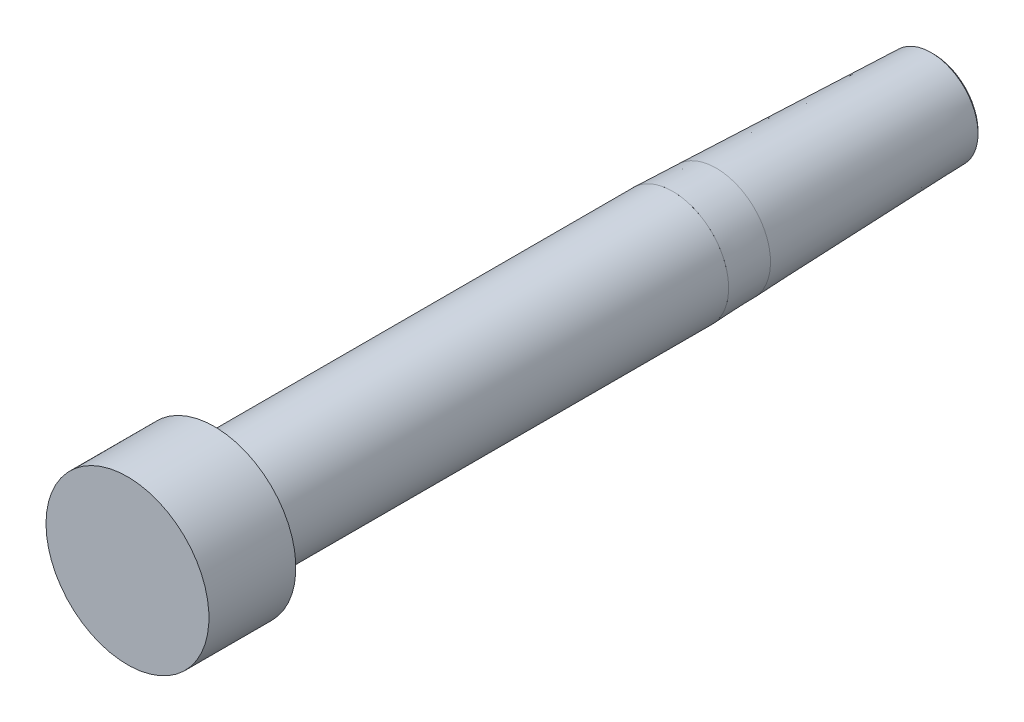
ISO-10303-21;
HEADER;
FILE_DESCRIPTION(('STEP AP214'),'2;1');
FILE_NAME('part.step','',(''),(''),'','','');
FILE_SCHEMA(('AUTOMOTIVE_DESIGN { 1 0 10303 214 1 1 1 1 }'));
ENDSEC;
DATA;
#1=APPLICATION_CONTEXT('core data for automotive mechanical design processes');
#2=APPLICATION_PROTOCOL_DEFINITION('international standard','automotive_design',2000,#1);
#3=PRODUCT_CONTEXT('',#1,'mechanical');
#4=PRODUCT('Part','Part','',(#3));
#5=PRODUCT_RELATED_PRODUCT_CATEGORY('part','',(#4));
#6=PRODUCT_DEFINITION_FORMATION('','',#4);
#7=PRODUCT_DEFINITION_CONTEXT('part definition',#1,'design');
#8=PRODUCT_DEFINITION('design','',#6,#7);
#9=PRODUCT_DEFINITION_SHAPE('','',#8);
#10=(LENGTH_UNIT() NAMED_UNIT(*) SI_UNIT(.MILLI.,.METRE.));
#11=(NAMED_UNIT(*) PLANE_ANGLE_UNIT() SI_UNIT($,.RADIAN.));
#12=(NAMED_UNIT(*) SI_UNIT($,.STERADIAN.) SOLID_ANGLE_UNIT());
#13=UNCERTAINTY_MEASURE_WITH_UNIT(LENGTH_MEASURE(1.E-05),#10,'distance_accuracy_value','');
#14=(GEOMETRIC_REPRESENTATION_CONTEXT(3) GLOBAL_UNCERTAINTY_ASSIGNED_CONTEXT((#13)) GLOBAL_UNIT_ASSIGNED_CONTEXT((#10,
#11,#12)) REPRESENTATION_CONTEXT('',''));
#15=CARTESIAN_POINT('',(0.,0.,0.));
#16=DIRECTION('',(0.,0.,1.));
#17=DIRECTION('',(1.,0.,0.));
#18=AXIS2_PLACEMENT_3D('',#15,#16,#17);
#19=CARTESIAN_POINT('',(-5.50000000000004,49.3508529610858,-37.1));
#20=DIRECTION('',(0.,0.,-1.));
#21=DIRECTION('',(0.866025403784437,0.500000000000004,0.));
#22=AXIS2_PLACEMENT_3D('',#19,#20,#21);
#23=PLANE('',#22);
#24=CARTESIAN_POINT('',(-5.50000000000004,49.3508529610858,-37.1));
#25=DIRECTION('',(0.,0.,-1.));
#26=DIRECTION('',(0.866025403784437,0.500000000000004,0.));
#27=AXIS2_PLACEMENT_3D('',#24,#25,#26);
#28=CIRCLE('',#27,2.05079230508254);
#29=CARTESIAN_POINT('',(-3.72396176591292,50.3762491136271,-37.1));
#30=VERTEX_POINT('',#29);
#31=EDGE_CURVE('E44',#30,#30,#28,.F.);
#32=ORIENTED_EDGE('',*,*,#31,.F.);
#33=EDGE_LOOP('',(#32));
#34=FACE_BOUND('',#33,.T.);
#35=ADVANCED_FACE('F31',(#34),#23,.T.);
#36=CARTESIAN_POINT('',(-5.50000000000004,49.3508529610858,-36.9963815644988));
#37=DIRECTION('',(0.,0.,1.));
#38=DIRECTION('',(-0.866025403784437,-0.500000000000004,0.));
#39=AXIS2_PLACEMENT_3D('',#36,#37,#38);
#40=CONICAL_SURFACE('',#39,2.15441074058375,0.785398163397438);
#41=ORIENTED_EDGE('',*,*,#31,.T.);
#42=EDGE_LOOP('',(#41));
#43=FACE_BOUND('',#42,.T.);
#44=CARTESIAN_POINT('',(-5.50000000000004,49.3508529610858,-36.9963815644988));
#45=DIRECTION('',(0.,0.,-1.));
#46=DIRECTION('',(0.866025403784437,0.500000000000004,0.));
#47=AXIS2_PLACEMENT_3D('',#44,#45,#46);
#48=CIRCLE('',#47,2.15441074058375);
#49=CARTESIAN_POINT('',(-3.63422556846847,50.4280583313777,-36.9963815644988));
#50=VERTEX_POINT('',#49);
#51=EDGE_CURVE('E52',#50,#50,#48,.T.);
#52=ORIENTED_EDGE('',*,*,#51,.T.);
#53=EDGE_LOOP('',(#52));
#54=FACE_BOUND('',#53,.T.);
#55=ADVANCED_FACE('F83',(#43,#54),#40,.T.);
#56=CARTESIAN_POINT('',(-5.50000000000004,49.3508529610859,-27.1));
#57=DIRECTION('',(0.,0.,1.));
#58=DIRECTION('',(-0.866025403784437,-0.500000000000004,0.));
#59=AXIS2_PLACEMENT_3D('',#56,#57,#58);
#60=CONICAL_SURFACE('',#59,2.5,0.0349065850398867);
#61=ORIENTED_EDGE('',*,*,#51,.F.);
#62=EDGE_LOOP('',(#61));
#63=FACE_BOUND('',#62,.T.);
#64=CARTESIAN_POINT('',(-5.50000000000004,49.3508529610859,-27.1));
#65=DIRECTION('',(0.,0.,1.));
#66=DIRECTION('',(-0.866025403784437,-0.500000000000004,0.));
#67=AXIS2_PLACEMENT_3D('',#64,#65,#66);
#68=CIRCLE('',#67,2.5);
#69=CARTESIAN_POINT('',(-7.66506350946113,48.1008529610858,-27.1));
#70=VERTEX_POINT('',#69);
#71=EDGE_CURVE('E54',#70,#70,#68,.T.);
#72=ORIENTED_EDGE('',*,*,#71,.F.);
#73=EDGE_LOOP('',(#72));
#74=FACE_BOUND('',#73,.T.);
#75=ADVANCED_FACE('F89',(#63,#74),#60,.T.);
#76=CARTESIAN_POINT('',(-5.50000000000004,49.3508529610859,-27.1));
#77=DIRECTION('',(0.,0.,1.));
#78=DIRECTION('',(-0.866025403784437,-0.500000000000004,0.));
#79=AXIS2_PLACEMENT_3D('',#76,#77,#78);
#80=CONICAL_SURFACE('',#79,2.5,0.0349065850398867);
#81=CARTESIAN_POINT('',(-5.50000000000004,49.3508529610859,-25.1));
#82=DIRECTION('',(0.,0.,1.));
#83=DIRECTION('',(-0.866025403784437,-0.500000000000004,0.));
#84=AXIS2_PLACEMENT_3D('',#81,#82,#83);
#85=CIRCLE('',#84,2.56984153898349);
#86=CARTESIAN_POINT('',(-7.72554805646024,48.0659321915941,-25.1));
#87=VERTEX_POINT('',#86);
#88=EDGE_CURVE('E35',#87,#87,#85,.T.);
#89=ORIENTED_EDGE('',*,*,#88,.F.);
#90=EDGE_LOOP('',(#89));
#91=FACE_BOUND('',#90,.T.);
#92=ORIENTED_EDGE('',*,*,#71,.T.);
#93=EDGE_LOOP('',(#92));
#94=FACE_BOUND('',#93,.T.);
#95=ADVANCED_FACE('F96',(#91,#94),#80,.T.);
#96=CARTESIAN_POINT('',(-5.50000000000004,49.3508529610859,-25.1));
#97=DIRECTION('',(0.,0.,1.));
#98=DIRECTION('',(-0.866025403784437,-0.500000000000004,0.));
#99=AXIS2_PLACEMENT_3D('',#96,#97,#98);
#100=PLANE('',#99);
#101=CARTESIAN_POINT('',(-5.50000000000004,49.3508529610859,-25.100000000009));
#102=DIRECTION('',(0.,0.,1.));
#103=DIRECTION('',(0.,-1.,0.));
#104=AXIS2_PLACEMENT_3D('',#101,#102,#103);
#105=CIRCLE('',#104,2.57);
#106=CARTESIAN_POINT('',(-5.50000000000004,46.7808529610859,-25.100000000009));
#107=VERTEX_POINT('',#106);
#108=EDGE_CURVE('E39',#107,#107,#105,.F.);
#109=ORIENTED_EDGE('',*,*,#108,.T.);
#110=EDGE_LOOP('',(#109));
#111=FACE_BOUND('',#110,.T.);
#112=ORIENTED_EDGE('',*,*,#88,.T.);
#113=EDGE_LOOP('',(#112));
#114=FACE_BOUND('',#113,.T.);
#115=ADVANCED_FACE('F79',(#111,#114),#100,.F.);
#116=CARTESIAN_POINT('',(-5.50000000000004,49.3508529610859,-500000.));
#117=DIRECTION('',(0.,0.,1.));
#118=DIRECTION('',(1.,0.,0.));
#119=AXIS2_PLACEMENT_3D('',#116,#117,#118);
#120=CYLINDRICAL_SURFACE('',#119,2.57);
#121=ORIENTED_EDGE('',*,*,#108,.F.);
#122=EDGE_LOOP('',(#121));
#123=FACE_BOUND('',#122,.T.);
#124=CARTESIAN_POINT('',(-5.50000000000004,49.3508529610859,-4.));
#125=DIRECTION('',(0.,0.,1.));
#126=DIRECTION('',(1.,0.,0.));
#127=AXIS2_PLACEMENT_3D('',#124,#125,#126);
#128=CIRCLE('',#127,2.57);
#129=CARTESIAN_POINT('',(-2.93000000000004,49.3508529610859,-4.));
#130=VERTEX_POINT('',#129);
#131=EDGE_CURVE('E10',#130,#130,#128,.T.);
#132=ORIENTED_EDGE('',*,*,#131,.F.);
#133=EDGE_LOOP('',(#132));
#134=FACE_BOUND('',#133,.T.);
#135=ADVANCED_FACE('F33',(#123,#134),#120,.T.);
#136=CARTESIAN_POINT('',(-5.50000000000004,49.3508529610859,-4.));
#137=DIRECTION('',(0.,0.,1.));
#138=DIRECTION('',(1.,0.,0.));
#139=AXIS2_PLACEMENT_3D('',#136,#137,#138);
#140=PLANE('',#139);
#141=ORIENTED_EDGE('',*,*,#131,.T.);
#142=EDGE_LOOP('',(#141));
#143=FACE_BOUND('',#142,.T.);
#144=CARTESIAN_POINT('',(-5.50000000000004,49.3508529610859,-4.));
#145=DIRECTION('',(0.,0.,1.));
#146=DIRECTION('',(1.,0.,0.));
#147=AXIS2_PLACEMENT_3D('',#144,#145,#146);
#148=CIRCLE('',#147,3.75);
#149=CARTESIAN_POINT('',(-9.25000000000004,49.3508529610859,-4.));
#150=VERTEX_POINT('',#149);
#151=EDGE_CURVE('E62',#150,#150,#148,.T.);
#152=ORIENTED_EDGE('',*,*,#151,.F.);
#153=EDGE_LOOP('',(#152));
#154=FACE_BOUND('',#153,.T.);
#155=ADVANCED_FACE('F70',(#143,#154),#140,.F.);
#156=CARTESIAN_POINT('',(-5.50000000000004,49.3508529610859,10.6066017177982));
#157=DIRECTION('',(0.,0.,-1.));
#158=DIRECTION('',(-1.,0.,0.));
#159=AXIS2_PLACEMENT_3D('',#156,#157,#158);
#160=CYLINDRICAL_SURFACE('',#159,3.75);
#161=CARTESIAN_POINT('',(-5.50000000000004,49.3508529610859,0.));
#162=DIRECTION('',(0.,0.,-1.));
#163=DIRECTION('',(-1.,0.,0.));
#164=AXIS2_PLACEMENT_3D('',#161,#162,#163);
#165=CIRCLE('',#164,3.75);
#166=CARTESIAN_POINT('',(-9.25000000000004,49.3508529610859,0.));
#167=VERTEX_POINT('',#166);
#168=EDGE_CURVE('E47',#167,#167,#165,.T.);
#169=CARTESIAN_POINT('',(-9.25000000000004,49.3508529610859,0.));
#170=CARTESIAN_POINT('',(-9.25000000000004,49.3508529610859,-0.0416666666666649));
#171=CARTESIAN_POINT('',(-9.25000000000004,49.3508529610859,-0.0833333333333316));
#172=CARTESIAN_POINT('',(-9.25000000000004,49.3508529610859,-0.166666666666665));
#173=CARTESIAN_POINT('',(-9.25000000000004,49.3508529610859,-0.208333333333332));
#174=CARTESIAN_POINT('',(-9.25000000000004,49.3508529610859,-0.291666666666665));
#175=CARTESIAN_POINT('',(-9.25000000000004,49.3508529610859,-0.333333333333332));
#176=CARTESIAN_POINT('',(-9.25000000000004,49.3508529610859,-0.416666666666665));
#177=CARTESIAN_POINT('',(-9.25000000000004,49.3508529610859,-0.458333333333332));
#178=CARTESIAN_POINT('',(-9.25000000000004,49.3508529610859,-0.541666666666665));
#179=CARTESIAN_POINT('',(-9.25000000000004,49.3508529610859,-0.583333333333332));
#180=CARTESIAN_POINT('',(-9.25000000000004,49.3508529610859,-0.666666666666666));
#181=CARTESIAN_POINT('',(-9.25000000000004,49.3508529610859,-0.708333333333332));
#182=CARTESIAN_POINT('',(-9.25000000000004,49.3508529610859,-0.791666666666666));
#183=CARTESIAN_POINT('',(-9.25000000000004,49.3508529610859,-0.833333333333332));
#184=CARTESIAN_POINT('',(-9.25000000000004,49.3508529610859,-0.916666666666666));
#185=CARTESIAN_POINT('',(-9.25000000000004,49.3508529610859,-0.958333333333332));
#186=CARTESIAN_POINT('',(-9.25000000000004,49.3508529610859,-1.04166666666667));
#187=CARTESIAN_POINT('',(-9.25000000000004,49.3508529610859,-1.08333333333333));
#188=CARTESIAN_POINT('',(-9.25000000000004,49.3508529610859,-1.16666666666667));
#189=CARTESIAN_POINT('',(-9.25000000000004,49.3508529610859,-1.20833333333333));
#190=CARTESIAN_POINT('',(-9.25000000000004,49.3508529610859,-1.29166666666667));
#191=CARTESIAN_POINT('',(-9.25000000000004,49.3508529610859,-1.33333333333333));
#192=CARTESIAN_POINT('',(-9.25000000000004,49.3508529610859,-1.41666666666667));
#193=CARTESIAN_POINT('',(-9.25000000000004,49.3508529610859,-1.45833333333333));
#194=CARTESIAN_POINT('',(-9.25000000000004,49.3508529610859,-1.54166666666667));
#195=CARTESIAN_POINT('',(-9.25000000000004,49.3508529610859,-1.58333333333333));
#196=CARTESIAN_POINT('',(-9.25000000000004,49.3508529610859,-1.66666666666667));
#197=CARTESIAN_POINT('',(-9.25000000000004,49.3508529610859,-1.70833333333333));
#198=CARTESIAN_POINT('',(-9.25000000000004,49.3508529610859,-1.79166666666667));
#199=CARTESIAN_POINT('',(-9.25000000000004,49.3508529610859,-1.83333333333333));
#200=CARTESIAN_POINT('',(-9.25000000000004,49.3508529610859,-1.91666666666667));
#201=CARTESIAN_POINT('',(-9.25000000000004,49.3508529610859,-1.95833333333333));
#202=CARTESIAN_POINT('',(-9.25000000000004,49.3508529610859,-2.04166666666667));
#203=CARTESIAN_POINT('',(-9.25000000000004,49.3508529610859,-2.08333333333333));
#204=CARTESIAN_POINT('',(-9.25000000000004,49.3508529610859,-2.16666666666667));
#205=CARTESIAN_POINT('',(-9.25000000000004,49.3508529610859,-2.20833333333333));
#206=CARTESIAN_POINT('',(-9.25000000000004,49.3508529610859,-2.29166666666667));
#207=CARTESIAN_POINT('',(-9.25000000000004,49.3508529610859,-2.33333333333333));
#208=CARTESIAN_POINT('',(-9.25000000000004,49.3508529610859,-2.41666666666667));
#209=CARTESIAN_POINT('',(-9.25000000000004,49.3508529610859,-2.45833333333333));
#210=CARTESIAN_POINT('',(-9.25000000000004,49.3508529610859,-2.54166666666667));
#211=CARTESIAN_POINT('',(-9.25000000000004,49.3508529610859,-2.58333333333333));
#212=CARTESIAN_POINT('',(-9.25000000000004,49.3508529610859,-2.66666666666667));
#213=CARTESIAN_POINT('',(-9.25000000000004,49.3508529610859,-2.70833333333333));
#214=CARTESIAN_POINT('',(-9.25000000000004,49.3508529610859,-2.79166666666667));
#215=CARTESIAN_POINT('',(-9.25000000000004,49.3508529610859,-2.83333333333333));
#216=CARTESIAN_POINT('',(-9.25000000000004,49.3508529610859,-2.91666666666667));
#217=CARTESIAN_POINT('',(-9.25000000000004,49.3508529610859,-2.95833333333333));
#218=CARTESIAN_POINT('',(-9.25000000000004,49.3508529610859,-3.04166666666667));
#219=CARTESIAN_POINT('',(-9.25000000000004,49.3508529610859,-3.08333333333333));
#220=CARTESIAN_POINT('',(-9.25000000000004,49.3508529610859,-3.16666666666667));
#221=CARTESIAN_POINT('',(-9.25000000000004,49.3508529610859,-3.20833333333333));
#222=CARTESIAN_POINT('',(-9.25000000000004,49.3508529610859,-3.29166666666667));
#223=CARTESIAN_POINT('',(-9.25000000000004,49.3508529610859,-3.33333333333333));
#224=CARTESIAN_POINT('',(-9.25000000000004,49.3508529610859,-3.41666666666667));
#225=CARTESIAN_POINT('',(-9.25000000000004,49.3508529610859,-3.45833333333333));
#226=CARTESIAN_POINT('',(-9.25000000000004,49.3508529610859,-3.54166666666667));
#227=CARTESIAN_POINT('',(-9.25000000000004,49.3508529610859,-3.58333333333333));
#228=CARTESIAN_POINT('',(-9.25000000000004,49.3508529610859,-3.66666666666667));
#229=CARTESIAN_POINT('',(-9.25000000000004,49.3508529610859,-3.70833333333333));
#230=CARTESIAN_POINT('',(-9.25000000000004,49.3508529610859,-3.79166666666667));
#231=CARTESIAN_POINT('',(-9.25000000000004,49.3508529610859,-3.83333333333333));
#232=CARTESIAN_POINT('',(-9.25000000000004,49.3508529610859,-3.91666666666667));
#233=CARTESIAN_POINT('',(-9.25000000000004,49.3508529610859,-3.95833333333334));
#234=CARTESIAN_POINT('',(-9.25000000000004,49.3508529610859,-4.));
#235=B_SPLINE_CURVE_WITH_KNOTS('',3,(#169,#170,#171,#172,#173,#174,#175,#176,#177,#178,#179,
#180,#181,#182,#183,#184,#185,#186,#187,#188,#189,#190,#191,#192,#193,#194,#195,#196,#197,#198,
#199,#200,#201,#202,#203,#204,#205,#206,#207,#208,#209,#210,#211,#212,#213,#214,#215,#216,#217,
#218,#219,#220,#221,#222,#223,#224,#225,#226,#227,#228,#229,#230,#231,#232,#233,#234),
.UNSPECIFIED.,.F.,.F.,(4,2,2,2,2,2,2,2,2,2,2,2,2,2,2,2,2,2,2,2,2,2,2,2,2,2,2,2,2,2,2,2,4),(0.,
0.125,0.25,0.375,0.5,0.625000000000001,0.750000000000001,0.875000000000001,1.,1.125,1.25,1.375,
1.5,1.625,1.75,1.875,2.,2.125,2.25,2.375,2.5,2.625,2.75,2.875,3.,3.125,3.25,3.375,3.5,3.625,
3.75,3.875,4.),.UNSPECIFIED.);
#236=EDGE_CURVE('BSEAM68',#167,#150,#235,.T.);
#237=ORIENTED_EDGE('',*,*,#168,.T.);
#238=ORIENTED_EDGE('',*,*,#151,.T.);
#239=ORIENTED_EDGE('',*,*,#236,.T.);
#240=ORIENTED_EDGE('',*,*,#236,.F.);
#241=EDGE_LOOP('',(#237,#239,#238,#240));
#242=FACE_BOUND('',#241,.T.);
#243=ADVANCED_FACE('F68',(#242),#160,.T.);
#244=CARTESIAN_POINT('',(-27.5,68.,0.));
#245=DIRECTION('',(0.,0.,-1.));
#246=DIRECTION('',(-1.,0.,0.));
#247=AXIS2_PLACEMENT_3D('',#244,#245,#246);
#248=PLANE('',#247);
#249=ORIENTED_EDGE('',*,*,#168,.F.);
#250=EDGE_LOOP('',(#249));
#251=FACE_BOUND('',#250,.T.);
#252=ADVANCED_FACE('F77',(#251),#248,.F.);
#253=CLOSED_SHELL('',(#35,#55,#75,#95,#115,#135,#155,#243,#252));
#254=MANIFOLD_SOLID_BREP('B2',#253);
#255=ADVANCED_BREP_SHAPE_REPRESENTATION('',(#18,#254),#14);
#256=SHAPE_DEFINITION_REPRESENTATION(#9,#255);
ENDSEC;
END-ISO-10303-21;
